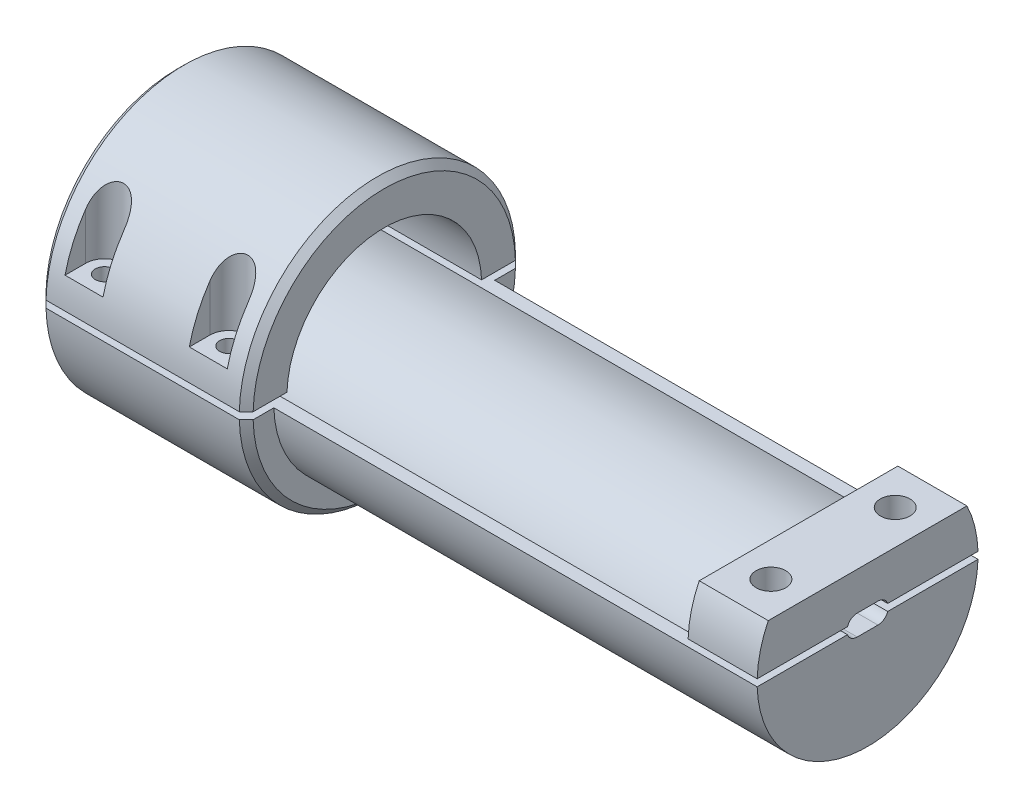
from build123d import *

# Parameters (mm, degrees)
LINEAR_AUSTRAGEN1_DEPTH              = 23
SKIZZE4_R                            = 14.1
LINEAR_AUSTRAGEN2_DEPTH              = 90
LINEAR_AUSTRAGEN5_DEPTH              = 15.5
F_2_7_2_7_DURCHMESSER_BOHRUNG1_D     = 2.7
F_2_7_2_7_DURCHMESSER_BOHRUNG1_DEPTH = 4
F_4_3_4_3_DURCHMESSER_BOHRUNG1_D     = 4.3
F_4_3_4_3_DURCHMESSER_BOHRUNG1_DEPTH = 7
FASE1_SIZE                           = 1
SKIZZE13_W                           = 100
SKIZZE13_H                           = 1
LINEAR_AUSTRAGEN3_DEPTH              = 35
LINEAR_AUSTRAGEN4_DEPTH              = 104.921845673
M2_5_GEWINDEBOHRUNG1_AT_2_COUNT      = 2
M2_5_GEWINDEBOHRUNG1_AT_2_PITCH      = 33
M2_5_GEWINDEBOHRUNG1_AT_3_COUNT      = 2
M2_5_GEWINDEBOHRUNG1_AT_3_PITCH      = 18
M2_5_GEWINDEBOHRUNG1_AT_4_COUNT      = 2
M2_5_GEWINDEBOHRUNG1_AT_4_PITCH      = 37.589892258
M4_GEWINDEBOHRUNG1_AT_2_COUNT        = 2
M4_GEWINDEBOHRUNG1_AT_2_PITCH        = 18


with BuildPart() as part:
    # Skizze1 → Rotation1 (revolve)
    with BuildSketch(Plane.XY, mode=Mode.PRIVATE) as rotation1_sk:
        Polygon((0, 0), (0, 16), (-70, 16), (-70, 20), (-100, 20), (-100, 0), align=None)
    revolve(rotation1_sk.sketch.rotate(Axis((0, 0, 0), (-1, 0, 0)), 90), axis=Axis((0, 0, 0), (-1, 0, 0)))

    # Skizze2 → Linear austragen1 (cut, symmetric)
    with BuildSketch(Plane.XY):
        Polygon((0, 7), (-10, 7), (-10, 0), (-70, 0), (-70, 16), (0, 16), align=None)
    extrude(amount=LINEAR_AUSTRAGEN1_DEPTH, both=True, mode=Mode.SUBTRACT)

    # Skizze4 → Linear austragen2 (cut)
    with BuildSketch(Plane.ZY.offset(100)):
        Circle(SKIZZE4_R)
    extrude(amount=-LINEAR_AUSTRAGEN2_DEPTH, mode=Mode.SUBTRACT)

    # Skizze15 → Linear austragen5 (cut)
    with BuildSketch(Plane(origin=(0, 20, 0), x_dir=(-1, 0, 0), z_dir=(0, 1, 0))):
        with BuildLine():
            Line((91.25, 16.5), (91.25, 20))
            Line((91.25, 20), (96.75, 20))
            Line((96.75, 20), (96.75, 16.5))
            ThreePointArc((96.75, 16.5), (94, 13.75), (91.25, 16.5))
        make_face()
        with BuildLine():
            Line((78.75, -20), (73.25, -20))
            Line((73.25, -20), (73.25, -16.5))
            ThreePointArc((73.25, -16.5), (76, -13.75), (78.75, -16.5))
            Line((78.75, -16.5), (78.75, -20))
        make_face()
        with BuildLine():
            Line((96.75, -20), (96.75, -16.5))
            ThreePointArc((96.75, -16.5), (94, -13.75), (91.25, -16.5))
            Line((91.25, -16.5), (91.25, -20))
            Line((91.25, -20), (96.75, -20))
        make_face()
        with BuildLine():
            Line((73.25, 20), (73.25, 16.5))
            ThreePointArc((73.25, 16.5), (76, 13.75), (78.75, 16.5))
            Line((78.75, 16.5), (78.75, 20))
            Line((78.75, 20), (73.25, 20))
        make_face()
    extrude(amount=-LINEAR_AUSTRAGEN5_DEPTH, mode=Mode.SUBTRACT)

    # 2.7 _2.7_ Durchmesser Bohrung1
    with Locations(Plane(origin=(0, 4.5, 0), x_dir=(-1, 0, 0), z_dir=(0, 1, 0))):
        with Locations((76, -16.5), (94, -16.5), (94, 16.5), (76, 16.5)):
            Hole(F_2_7_2_7_DURCHMESSER_BOHRUNG1_D / 2, depth=F_2_7_2_7_DURCHMESSER_BOHRUNG1_DEPTH)

    # 4.3 _4.3_ Durchmesser Bohrung1
    with Locations(Plane(origin=(0, 7, 0), x_dir=(-1, 0, 0), z_dir=(0, 1, 0))):
        with Locations((5, 9), (5, -9)):
            Hole(F_4_3_4_3_DURCHMESSER_BOHRUNG1_D / 2, depth=F_4_3_4_3_DURCHMESSER_BOHRUNG1_DEPTH)

    # Fase1
    fase1_edges = [part.edges().sort_by_distance(p)[0] for p in [
        (-100, 0, 20),
        (-70, 0, 20),
    ]]
    chamfer(fase1_edges, length=FASE1_SIZE)

    # Skizze13 → Linear austragen3 (cut, symmetric)
    with BuildSketch(Plane.XY):
        with Locations((-50, 0)):
            Rectangle(SKIZZE13_W, SKIZZE13_H)
    extrude(amount=LINEAR_AUSTRAGEN3_DEPTH, both=True, mode=Mode.SUBTRACT)


with BuildPart() as linear_austragen3_piece_1:
    # of the separate pieces the step leaves, piece 1, a body of its own (linear_austragen3_pieces)
    add(part.part.solids().sort_by_distance((-70, -0.5, 18.993419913))[0])


with BuildPart() as linear_austragen3_piece_2:
    # of the separate pieces the step leaves, piece 2, a body of its own (linear_austragen3_pieces)
    add(part.part.solids().sort_by_distance((-70, 0.5, -14.091131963))[0])


with BuildPart() as linear_austragen3_piece_3:
    # of the separate pieces the step leaves, piece 3, a body of its own (linear_austragen3_pieces)
    add(part.part.solids().sort_by_distance((0, 0.5, -15.992185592))[0])


with BuildPart() as linear_austragen4_tool:
    # Skizze14 → Linear austragen4 (new, through all)
    with BuildSketch(Plane(origin=(0, 0, 0), x_dir=(0, 0, -1), z_dir=(1, 0, 0))):
        with BuildLine():
            Line((-1.5, -1.5), (1.5, -1.5))
            ThreePointArc((1.5, -1.5), (3, 0), (1.5, 1.5))
            Line((1.5, 1.5), (-1.5, 1.5))
            ThreePointArc((-1.5, 1.5), (-3, 0), (-1.5, -1.5))
        make_face()
    extrude(amount=-LINEAR_AUSTRAGEN4_DEPTH)


with BuildPart() as linear_austragen3_piece_1_1:
    add(linear_austragen3_piece_1.part)

    # Linear austragen4: cut by linear_austragen4_tool
    add(linear_austragen4_tool.part, mode=Mode.SUBTRACT)

    # Skizze7 → M2.5 Gewindebohrung1 (revolve, cut)
    with BuildSketch(Plane(origin=(-94, -0.5, 16.5), x_dir=(0, 0, 1), z_dir=(1, 0, 0))):
        Polygon((0, 0), (0, 6.615882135), (1.025, 6), (1.025, 0), align=None)
    m2_5_gewindebohrung1 = revolve(axis=Axis((-94, 5.85, 16.5), (0, -1, 0)), mode=Mode.SUBTRACT)

    # M2.5 Gewindebohrung1 at 2: M2.5 Gewindebohrung1 ×2
    with Locations(*[(0, 0, -i * M2_5_GEWINDEBOHRUNG1_AT_2_PITCH) for i in range(1, M2_5_GEWINDEBOHRUNG1_AT_2_COUNT)]):
        add(m2_5_gewindebohrung1, mode=Mode.SUBTRACT)

    # M2.5 Gewindebohrung1 at 3: M2.5 Gewindebohrung1 ×2
    with Locations(*[(i * M2_5_GEWINDEBOHRUNG1_AT_3_PITCH, 0, 0) for i in range(1, M2_5_GEWINDEBOHRUNG1_AT_3_COUNT)]):
        add(m2_5_gewindebohrung1, mode=Mode.SUBTRACT)

    # M2.5 Gewindebohrung1 at 4: M2.5 Gewindebohrung1 ×2
    with Locations(*[Vector(0.47885213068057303, 0, -0.8778955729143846) * (i * M2_5_GEWINDEBOHRUNG1_AT_4_PITCH) for i in range(1, M2_5_GEWINDEBOHRUNG1_AT_4_COUNT)]):
        add(m2_5_gewindebohrung1, mode=Mode.SUBTRACT)

    # Skizze11 → M4 Gewindebohrung1 (revolve, cut)
    with BuildSketch(Plane(origin=(-5, -0.5, -9), x_dir=(0, 0, 1), z_dir=(1, 0, 0))):
        Polygon((0, 0), (0, 9.491420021), (1.65, 8.5), (1.65, 0), align=None)
    m4_gewindebohrung1 = revolve(axis=Axis((-5, 5.85, -9), (0, -1, 0)), mode=Mode.SUBTRACT)

    # M4 Gewindebohrung1 at 2: M4 Gewindebohrung1 ×2
    with Locations(*[(0, 0, i * M4_GEWINDEBOHRUNG1_AT_2_PITCH) for i in range(1, M4_GEWINDEBOHRUNG1_AT_2_COUNT)]):
        add(m4_gewindebohrung1, mode=Mode.SUBTRACT)


with BuildPart() as linear_austragen3_piece_3_1:
    add(linear_austragen3_piece_3.part)

    # Linear austragen4: cut by linear_austragen4_tool
    add(linear_austragen4_tool.part, mode=Mode.SUBTRACT)


solid = Compound([linear_austragen3_piece_2.part, linear_austragen3_piece_1_1.part, linear_austragen3_piece_3_1.part])
